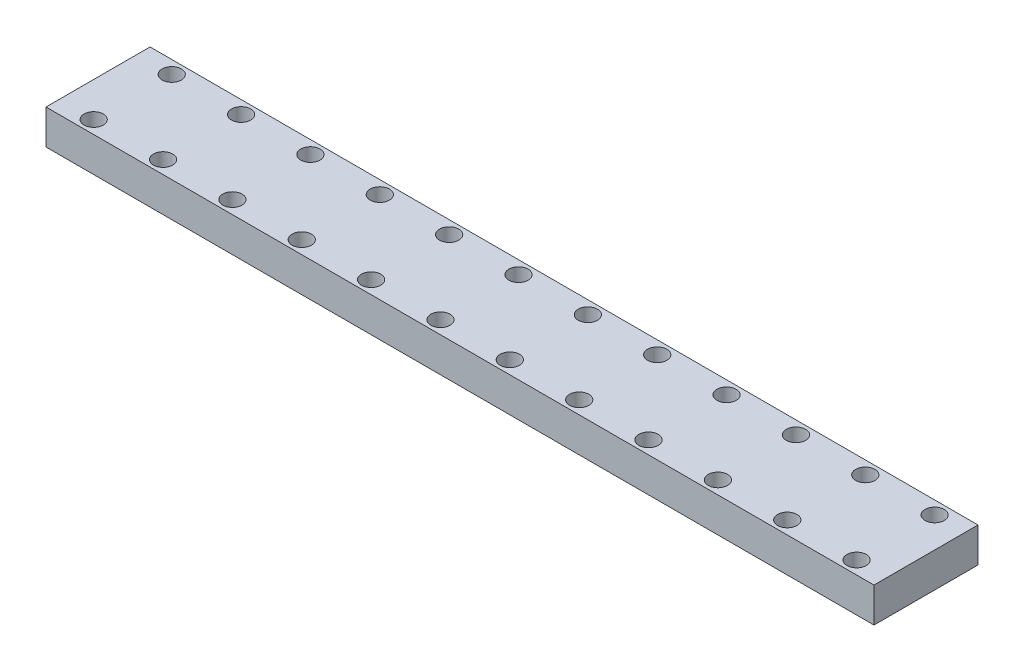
ISO-10303-21;
HEADER;
FILE_DESCRIPTION(('STEP AP214'),'2;1');
FILE_NAME('part.step','',(''),(''),'','','');
FILE_SCHEMA(('AUTOMOTIVE_DESIGN { 1 0 10303 214 1 1 1 1 }'));
ENDSEC;
DATA;
#1=APPLICATION_CONTEXT('core data for automotive mechanical design processes');
#2=APPLICATION_PROTOCOL_DEFINITION('international standard','automotive_design',2000,#1);
#3=PRODUCT_CONTEXT('',#1,'mechanical');
#4=PRODUCT('Part','Part','',(#3));
#5=PRODUCT_RELATED_PRODUCT_CATEGORY('part','',(#4));
#6=PRODUCT_DEFINITION_FORMATION('','',#4);
#7=PRODUCT_DEFINITION_CONTEXT('part definition',#1,'design');
#8=PRODUCT_DEFINITION('design','',#6,#7);
#9=PRODUCT_DEFINITION_SHAPE('','',#8);
#10=(LENGTH_UNIT() NAMED_UNIT(*) SI_UNIT(.MILLI.,.METRE.));
#11=(NAMED_UNIT(*) PLANE_ANGLE_UNIT() SI_UNIT($,.RADIAN.));
#12=(NAMED_UNIT(*) SI_UNIT($,.STERADIAN.) SOLID_ANGLE_UNIT());
#13=UNCERTAINTY_MEASURE_WITH_UNIT(LENGTH_MEASURE(1.E-05),#10,'distance_accuracy_value','');
#14=(GEOMETRIC_REPRESENTATION_CONTEXT(3) GLOBAL_UNCERTAINTY_ASSIGNED_CONTEXT((#13)) GLOBAL_UNIT_ASSIGNED_CONTEXT((#10,
#11,#12)) REPRESENTATION_CONTEXT('',''));
#15=CARTESIAN_POINT('',(0.,0.,0.));
#16=DIRECTION('',(0.,0.,1.));
#17=DIRECTION('',(1.,0.,0.));
#18=AXIS2_PLACEMENT_3D('',#15,#16,#17);
#19=CARTESIAN_POINT('',(0.,8.,0.));
#20=DIRECTION('',(0.,1.,0.));
#21=DIRECTION('',(0.,0.,1.));
#22=AXIS2_PLACEMENT_3D('',#19,#20,#21);
#23=PLANE('',#22);
#24=CARTESIAN_POINT('',(145.285714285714,8.,10.4285714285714));
#25=DIRECTION('',(0.,1.,0.));
#26=DIRECTION('',(0.,0.,1.));
#27=AXIS2_PLACEMENT_3D('',#24,#25,#26);
#28=CIRCLE('',#27,2.22212411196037);
#29=CARTESIAN_POINT('',(145.285714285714,8.,12.6506955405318));
#30=VERTEX_POINT('',#29);
#31=EDGE_CURVE('E243',#30,#30,#28,.T.);
#32=ORIENTED_EDGE('',*,*,#31,.F.);
#33=EDGE_LOOP('',(#32));
#34=FACE_BOUND('',#33,.T.);
#35=CARTESIAN_POINT('',(113.285714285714,8.,10.4285714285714));
#36=DIRECTION('',(0.,1.,0.));
#37=DIRECTION('',(0.,0.,1.));
#38=AXIS2_PLACEMENT_3D('',#35,#36,#37);
#39=CIRCLE('',#38,2.22212411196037);
#40=CARTESIAN_POINT('',(113.285714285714,8.,12.6506955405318));
#41=VERTEX_POINT('',#40);
#42=EDGE_CURVE('E231',#41,#41,#39,.T.);
#43=ORIENTED_EDGE('',*,*,#42,.F.);
#44=EDGE_LOOP('',(#43));
#45=FACE_BOUND('',#44,.T.);
#46=CARTESIAN_POINT('',(81.2857142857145,8.,10.4285714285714));
#47=DIRECTION('',(0.,1.,0.));
#48=DIRECTION('',(0.,0.,1.));
#49=AXIS2_PLACEMENT_3D('',#46,#47,#48);
#50=CIRCLE('',#49,2.22212411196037);
#51=CARTESIAN_POINT('',(81.2857142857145,8.,12.6506955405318));
#52=VERTEX_POINT('',#51);
#53=EDGE_CURVE('E219',#52,#52,#50,.T.);
#54=ORIENTED_EDGE('',*,*,#53,.F.);
#55=EDGE_LOOP('',(#54));
#56=FACE_BOUND('',#55,.T.);
#57=CARTESIAN_POINT('',(49.2857142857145,8.,10.4285714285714));
#58=DIRECTION('',(0.,1.,0.));
#59=DIRECTION('',(0.,0.,1.));
#60=AXIS2_PLACEMENT_3D('',#57,#58,#59);
#61=CIRCLE('',#60,2.22212411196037);
#62=CARTESIAN_POINT('',(49.2857142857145,8.,12.6506955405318));
#63=VERTEX_POINT('',#62);
#64=EDGE_CURVE('E207',#63,#63,#61,.T.);
#65=ORIENTED_EDGE('',*,*,#64,.F.);
#66=EDGE_LOOP('',(#65));
#67=FACE_BOUND('',#66,.T.);
#68=CARTESIAN_POINT('',(17.2857142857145,8.,10.4285714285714));
#69=DIRECTION('',(0.,1.,0.));
#70=DIRECTION('',(0.,0.,1.));
#71=AXIS2_PLACEMENT_3D('',#68,#69,#70);
#72=CIRCLE('',#71,2.22212411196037);
#73=CARTESIAN_POINT('',(17.2857142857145,8.,12.6506955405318));
#74=VERTEX_POINT('',#73);
#75=EDGE_CURVE('E195',#74,#74,#72,.T.);
#76=ORIENTED_EDGE('',*,*,#75,.F.);
#77=EDGE_LOOP('',(#76));
#78=FACE_BOUND('',#77,.T.);
#79=CARTESIAN_POINT('',(-14.7142857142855,8.,10.4285714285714));
#80=DIRECTION('',(0.,1.,0.));
#81=DIRECTION('',(0.,0.,1.));
#82=AXIS2_PLACEMENT_3D('',#79,#80,#81);
#83=CIRCLE('',#82,2.22212411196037);
#84=CARTESIAN_POINT('',(-14.7142857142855,8.,12.6506955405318));
#85=VERTEX_POINT('',#84);
#86=EDGE_CURVE('E183',#85,#85,#83,.T.);
#87=ORIENTED_EDGE('',*,*,#86,.F.);
#88=EDGE_LOOP('',(#87));
#89=FACE_BOUND('',#88,.T.);
#90=CARTESIAN_POINT('',(145.285714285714,8.,-7.57142857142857));
#91=DIRECTION('',(0.,1.,0.));
#92=DIRECTION('',(0.,0.,1.));
#93=AXIS2_PLACEMENT_3D('',#90,#91,#92);
#94=CIRCLE('',#93,2.22212411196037);
#95=CARTESIAN_POINT('',(145.285714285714,8.,-5.3493044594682));
#96=VERTEX_POINT('',#95);
#97=EDGE_CURVE('E171',#96,#96,#94,.T.);
#98=ORIENTED_EDGE('',*,*,#97,.F.);
#99=EDGE_LOOP('',(#98));
#100=FACE_BOUND('',#99,.T.);
#101=CARTESIAN_POINT('',(113.285714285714,8.,-7.57142857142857));
#102=DIRECTION('',(0.,1.,0.));
#103=DIRECTION('',(0.,0.,1.));
#104=AXIS2_PLACEMENT_3D('',#101,#102,#103);
#105=CIRCLE('',#104,2.22212411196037);
#106=CARTESIAN_POINT('',(113.285714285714,8.,-5.3493044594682));
#107=VERTEX_POINT('',#106);
#108=EDGE_CURVE('E159',#107,#107,#105,.T.);
#109=ORIENTED_EDGE('',*,*,#108,.F.);
#110=EDGE_LOOP('',(#109));
#111=FACE_BOUND('',#110,.T.);
#112=CARTESIAN_POINT('',(81.2857142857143,8.,-7.57142857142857));
#113=DIRECTION('',(0.,1.,0.));
#114=DIRECTION('',(0.,0.,1.));
#115=AXIS2_PLACEMENT_3D('',#112,#113,#114);
#116=CIRCLE('',#115,2.22212411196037);
#117=CARTESIAN_POINT('',(81.2857142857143,8.,-5.3493044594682));
#118=VERTEX_POINT('',#117);
#119=EDGE_CURVE('E147',#118,#118,#116,.T.);
#120=ORIENTED_EDGE('',*,*,#119,.F.);
#121=EDGE_LOOP('',(#120));
#122=FACE_BOUND('',#121,.T.);
#123=CARTESIAN_POINT('',(49.2857142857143,8.,-7.57142857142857));
#124=DIRECTION('',(0.,1.,0.));
#125=DIRECTION('',(0.,0.,1.));
#126=AXIS2_PLACEMENT_3D('',#123,#124,#125);
#127=CIRCLE('',#126,2.22212411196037);
#128=CARTESIAN_POINT('',(49.2857142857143,8.,-5.3493044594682));
#129=VERTEX_POINT('',#128);
#130=EDGE_CURVE('E135',#129,#129,#127,.T.);
#131=ORIENTED_EDGE('',*,*,#130,.F.);
#132=EDGE_LOOP('',(#131));
#133=FACE_BOUND('',#132,.T.);
#134=CARTESIAN_POINT('',(17.2857142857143,8.,-7.57142857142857));
#135=DIRECTION('',(0.,1.,0.));
#136=DIRECTION('',(0.,0.,1.));
#137=AXIS2_PLACEMENT_3D('',#134,#135,#136);
#138=CIRCLE('',#137,2.22212411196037);
#139=CARTESIAN_POINT('',(17.2857142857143,8.,-5.3493044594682));
#140=VERTEX_POINT('',#139);
#141=EDGE_CURVE('E123',#140,#140,#138,.T.);
#142=ORIENTED_EDGE('',*,*,#141,.F.);
#143=EDGE_LOOP('',(#142));
#144=FACE_BOUND('',#143,.T.);
#145=CARTESIAN_POINT('',(-14.7142857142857,8.,-7.57142857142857));
#146=DIRECTION('',(0.,1.,0.));
#147=DIRECTION('',(0.,0.,1.));
#148=AXIS2_PLACEMENT_3D('',#145,#146,#147);
#149=CIRCLE('',#148,2.22212411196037);
#150=CARTESIAN_POINT('',(-14.7142857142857,8.,-5.3493044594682));
#151=VERTEX_POINT('',#150);
#152=EDGE_CURVE('E102',#151,#151,#149,.T.);
#153=ORIENTED_EDGE('',*,*,#152,.F.);
#154=EDGE_LOOP('',(#153));
#155=FACE_BOUND('',#154,.T.);
#156=DIRECTION('',(0.,0.,1.));
#157=VECTOR('',#156,1.);
#158=CARTESIAN_POINT('',(-22.7142857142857,8.,-10.5714285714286));
#159=LINE('',#158,#157);
#160=CARTESIAN_POINT('',(-22.7142857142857,8.,-10.5714285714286));
#161=VERTEX_POINT('',#160);
#162=CARTESIAN_POINT('',(-22.7142857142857,8.,13.4285714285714));
#163=VERTEX_POINT('',#162);
#164=EDGE_CURVE('E87',#161,#163,#159,.T.);
#165=ORIENTED_EDGE('',*,*,#164,.T.);
#166=DIRECTION('',(1.,0.,0.));
#167=VECTOR('',#166,1.);
#168=CARTESIAN_POINT('',(-22.7142857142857,8.,13.4285714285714));
#169=LINE('',#168,#167);
#170=CARTESIAN_POINT('',(168.285714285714,8.,13.4285714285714));
#171=VERTEX_POINT('',#170);
#172=EDGE_CURVE('E82',#163,#171,#169,.T.);
#173=ORIENTED_EDGE('',*,*,#172,.T.);
#174=DIRECTION('',(0.,0.,-1.));
#175=VECTOR('',#174,1.);
#176=CARTESIAN_POINT('',(168.285714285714,8.,-10.5714285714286));
#177=LINE('',#176,#175);
#178=CARTESIAN_POINT('',(168.285714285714,8.,-10.5714285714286));
#179=VERTEX_POINT('',#178);
#180=EDGE_CURVE('E85',#171,#179,#177,.T.);
#181=ORIENTED_EDGE('',*,*,#180,.T.);
#182=DIRECTION('',(-1.,0.,0.));
#183=VECTOR('',#182,1.);
#184=CARTESIAN_POINT('',(-22.7142857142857,8.,-10.5714285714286));
#185=LINE('',#184,#183);
#186=EDGE_CURVE('E52',#179,#161,#185,.T.);
#187=ORIENTED_EDGE('',*,*,#186,.T.);
#188=EDGE_LOOP('',(#165,#173,#181,#187));
#189=FACE_BOUND('',#188,.T.);
#190=CARTESIAN_POINT('',(1.28571428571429,8.,-7.57142857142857));
#191=DIRECTION('',(0.,1.,0.));
#192=DIRECTION('',(0.,0.,1.));
#193=AXIS2_PLACEMENT_3D('',#190,#191,#192);
#194=CIRCLE('',#193,2.22212411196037);
#195=CARTESIAN_POINT('',(1.28571428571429,8.,-5.3493044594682));
#196=VERTEX_POINT('',#195);
#197=EDGE_CURVE('E117',#196,#196,#194,.T.);
#198=ORIENTED_EDGE('',*,*,#197,.F.);
#199=EDGE_LOOP('',(#198));
#200=FACE_BOUND('',#199,.T.);
#201=CARTESIAN_POINT('',(33.2857142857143,8.,-7.57142857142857));
#202=DIRECTION('',(0.,1.,0.));
#203=DIRECTION('',(0.,0.,1.));
#204=AXIS2_PLACEMENT_3D('',#201,#202,#203);
#205=CIRCLE('',#204,2.22212411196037);
#206=CARTESIAN_POINT('',(33.2857142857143,8.,-5.3493044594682));
#207=VERTEX_POINT('',#206);
#208=EDGE_CURVE('E129',#207,#207,#205,.T.);
#209=ORIENTED_EDGE('',*,*,#208,.F.);
#210=EDGE_LOOP('',(#209));
#211=FACE_BOUND('',#210,.T.);
#212=CARTESIAN_POINT('',(65.2857142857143,8.,-7.57142857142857));
#213=DIRECTION('',(0.,1.,0.));
#214=DIRECTION('',(0.,0.,1.));
#215=AXIS2_PLACEMENT_3D('',#212,#213,#214);
#216=CIRCLE('',#215,2.22212411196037);
#217=CARTESIAN_POINT('',(65.2857142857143,8.,-5.3493044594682));
#218=VERTEX_POINT('',#217);
#219=EDGE_CURVE('E141',#218,#218,#216,.T.);
#220=ORIENTED_EDGE('',*,*,#219,.F.);
#221=EDGE_LOOP('',(#220));
#222=FACE_BOUND('',#221,.T.);
#223=CARTESIAN_POINT('',(97.2857142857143,8.,-7.57142857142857));
#224=DIRECTION('',(0.,1.,0.));
#225=DIRECTION('',(0.,0.,1.));
#226=AXIS2_PLACEMENT_3D('',#223,#224,#225);
#227=CIRCLE('',#226,2.22212411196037);
#228=CARTESIAN_POINT('',(97.2857142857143,8.,-5.3493044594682));
#229=VERTEX_POINT('',#228);
#230=EDGE_CURVE('E153',#229,#229,#227,.T.);
#231=ORIENTED_EDGE('',*,*,#230,.F.);
#232=EDGE_LOOP('',(#231));
#233=FACE_BOUND('',#232,.T.);
#234=CARTESIAN_POINT('',(129.285714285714,8.,-7.57142857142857));
#235=DIRECTION('',(0.,1.,0.));
#236=DIRECTION('',(0.,0.,1.));
#237=AXIS2_PLACEMENT_3D('',#234,#235,#236);
#238=CIRCLE('',#237,2.22212411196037);
#239=CARTESIAN_POINT('',(129.285714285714,8.,-5.3493044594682));
#240=VERTEX_POINT('',#239);
#241=EDGE_CURVE('E165',#240,#240,#238,.T.);
#242=ORIENTED_EDGE('',*,*,#241,.F.);
#243=EDGE_LOOP('',(#242));
#244=FACE_BOUND('',#243,.T.);
#245=CARTESIAN_POINT('',(161.285714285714,8.,-7.57142857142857));
#246=DIRECTION('',(0.,1.,0.));
#247=DIRECTION('',(0.,0.,1.));
#248=AXIS2_PLACEMENT_3D('',#245,#246,#247);
#249=CIRCLE('',#248,2.22212411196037);
#250=CARTESIAN_POINT('',(161.285714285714,8.,-5.3493044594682));
#251=VERTEX_POINT('',#250);
#252=EDGE_CURVE('E177',#251,#251,#249,.T.);
#253=ORIENTED_EDGE('',*,*,#252,.F.);
#254=EDGE_LOOP('',(#253));
#255=FACE_BOUND('',#254,.T.);
#256=CARTESIAN_POINT('',(1.28571428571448,8.,10.4285714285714));
#257=DIRECTION('',(0.,1.,0.));
#258=DIRECTION('',(0.,0.,1.));
#259=AXIS2_PLACEMENT_3D('',#256,#257,#258);
#260=CIRCLE('',#259,2.22212411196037);
#261=CARTESIAN_POINT('',(1.28571428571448,8.,12.6506955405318));
#262=VERTEX_POINT('',#261);
#263=EDGE_CURVE('E189',#262,#262,#260,.T.);
#264=ORIENTED_EDGE('',*,*,#263,.F.);
#265=EDGE_LOOP('',(#264));
#266=FACE_BOUND('',#265,.T.);
#267=CARTESIAN_POINT('',(33.2857142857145,8.,10.4285714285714));
#268=DIRECTION('',(0.,1.,0.));
#269=DIRECTION('',(0.,0.,1.));
#270=AXIS2_PLACEMENT_3D('',#267,#268,#269);
#271=CIRCLE('',#270,2.22212411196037);
#272=CARTESIAN_POINT('',(33.2857142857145,8.,12.6506955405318));
#273=VERTEX_POINT('',#272);
#274=EDGE_CURVE('E201',#273,#273,#271,.T.);
#275=ORIENTED_EDGE('',*,*,#274,.F.);
#276=EDGE_LOOP('',(#275));
#277=FACE_BOUND('',#276,.T.);
#278=CARTESIAN_POINT('',(65.2857142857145,8.,10.4285714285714));
#279=DIRECTION('',(0.,1.,0.));
#280=DIRECTION('',(0.,0.,1.));
#281=AXIS2_PLACEMENT_3D('',#278,#279,#280);
#282=CIRCLE('',#281,2.22212411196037);
#283=CARTESIAN_POINT('',(65.2857142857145,8.,12.6506955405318));
#284=VERTEX_POINT('',#283);
#285=EDGE_CURVE('E213',#284,#284,#282,.T.);
#286=ORIENTED_EDGE('',*,*,#285,.F.);
#287=EDGE_LOOP('',(#286));
#288=FACE_BOUND('',#287,.T.);
#289=CARTESIAN_POINT('',(97.2857142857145,8.,10.4285714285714));
#290=DIRECTION('',(0.,1.,0.));
#291=DIRECTION('',(0.,0.,1.));
#292=AXIS2_PLACEMENT_3D('',#289,#290,#291);
#293=CIRCLE('',#292,2.22212411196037);
#294=CARTESIAN_POINT('',(97.2857142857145,8.,12.6506955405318));
#295=VERTEX_POINT('',#294);
#296=EDGE_CURVE('E225',#295,#295,#293,.T.);
#297=ORIENTED_EDGE('',*,*,#296,.F.);
#298=EDGE_LOOP('',(#297));
#299=FACE_BOUND('',#298,.T.);
#300=CARTESIAN_POINT('',(129.285714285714,8.,10.4285714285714));
#301=DIRECTION('',(0.,1.,0.));
#302=DIRECTION('',(0.,0.,1.));
#303=AXIS2_PLACEMENT_3D('',#300,#301,#302);
#304=CIRCLE('',#303,2.22212411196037);
#305=CARTESIAN_POINT('',(129.285714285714,8.,12.6506955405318));
#306=VERTEX_POINT('',#305);
#307=EDGE_CURVE('E237',#306,#306,#304,.T.);
#308=ORIENTED_EDGE('',*,*,#307,.F.);
#309=EDGE_LOOP('',(#308));
#310=FACE_BOUND('',#309,.T.);
#311=CARTESIAN_POINT('',(161.285714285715,8.,10.4285714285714));
#312=DIRECTION('',(0.,1.,0.));
#313=DIRECTION('',(0.,0.,1.));
#314=AXIS2_PLACEMENT_3D('',#311,#312,#313);
#315=CIRCLE('',#314,2.22212411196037);
#316=CARTESIAN_POINT('',(161.285714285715,8.,12.6506955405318));
#317=VERTEX_POINT('',#316);
#318=EDGE_CURVE('E249',#317,#317,#315,.T.);
#319=ORIENTED_EDGE('',*,*,#318,.F.);
#320=EDGE_LOOP('',(#319));
#321=FACE_BOUND('',#320,.T.);
#322=ADVANCED_FACE('F35',(#34,#45,#56,#67,#78,#89,#100,#111,#122,#133,#144,#155,#189,#200,#211,
#222,#233,#244,#255,#266,#277,#288,#299,#310,#321),#23,.T.);
#323=CARTESIAN_POINT('',(0.,0.,0.));
#324=DIRECTION('',(0.,1.,0.));
#325=DIRECTION('',(0.,0.,1.));
#326=AXIS2_PLACEMENT_3D('',#323,#324,#325);
#327=PLANE('',#326);
#328=DIRECTION('',(0.,0.,1.));
#329=VECTOR('',#328,1.);
#330=CARTESIAN_POINT('',(-22.7142857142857,0.,-10.5714285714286));
#331=LINE('',#330,#329);
#332=CARTESIAN_POINT('',(-22.7142857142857,0.,-10.5714285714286));
#333=VERTEX_POINT('',#332);
#334=CARTESIAN_POINT('',(-22.7142857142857,0.,13.4285714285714));
#335=VERTEX_POINT('',#334);
#336=EDGE_CURVE('E99',#333,#335,#331,.T.);
#337=ORIENTED_EDGE('',*,*,#336,.F.);
#338=DIRECTION('',(-1.,0.,0.));
#339=VECTOR('',#338,1.);
#340=CARTESIAN_POINT('',(-22.7142857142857,0.,-10.5714285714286));
#341=LINE('',#340,#339);
#342=CARTESIAN_POINT('',(168.285714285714,0.,-10.5714285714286));
#343=VERTEX_POINT('',#342);
#344=EDGE_CURVE('E75',#343,#333,#341,.T.);
#345=ORIENTED_EDGE('',*,*,#344,.F.);
#346=DIRECTION('',(0.,0.,-1.));
#347=VECTOR('',#346,1.);
#348=CARTESIAN_POINT('',(168.285714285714,0.,-10.5714285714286));
#349=LINE('',#348,#347);
#350=CARTESIAN_POINT('',(168.285714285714,0.,13.4285714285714));
#351=VERTEX_POINT('',#350);
#352=EDGE_CURVE('E69',#351,#343,#349,.T.);
#353=ORIENTED_EDGE('',*,*,#352,.F.);
#354=DIRECTION('',(1.,0.,0.));
#355=VECTOR('',#354,1.);
#356=CARTESIAN_POINT('',(-22.7142857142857,0.,13.4285714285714));
#357=LINE('',#356,#355);
#358=EDGE_CURVE('E91',#335,#351,#357,.T.);
#359=ORIENTED_EDGE('',*,*,#358,.F.);
#360=EDGE_LOOP('',(#337,#345,#353,#359));
#361=FACE_BOUND('',#360,.T.);
#362=CARTESIAN_POINT('',(-14.7142857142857,0.,-7.57142857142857));
#363=DIRECTION('',(0.,1.,0.));
#364=DIRECTION('',(0.,0.,1.));
#365=AXIS2_PLACEMENT_3D('',#362,#363,#364);
#366=CIRCLE('',#365,2.22212411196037);
#367=CARTESIAN_POINT('',(-14.7142857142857,0.,-5.3493044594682));
#368=VERTEX_POINT('',#367);
#369=EDGE_CURVE('E114',#368,#368,#366,.T.);
#370=ORIENTED_EDGE('',*,*,#369,.T.);
#371=EDGE_LOOP('',(#370));
#372=FACE_BOUND('',#371,.T.);
#373=CARTESIAN_POINT('',(1.28571428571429,0.,-7.57142857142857));
#374=DIRECTION('',(0.,1.,0.));
#375=DIRECTION('',(0.,0.,1.));
#376=AXIS2_PLACEMENT_3D('',#373,#374,#375);
#377=CIRCLE('',#376,2.22212411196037);
#378=CARTESIAN_POINT('',(1.28571428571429,0.,-5.3493044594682));
#379=VERTEX_POINT('',#378);
#380=EDGE_CURVE('E120',#379,#379,#377,.T.);
#381=ORIENTED_EDGE('',*,*,#380,.T.);
#382=EDGE_LOOP('',(#381));
#383=FACE_BOUND('',#382,.T.);
#384=CARTESIAN_POINT('',(17.2857142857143,0.,-7.57142857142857));
#385=DIRECTION('',(0.,1.,0.));
#386=DIRECTION('',(0.,0.,1.));
#387=AXIS2_PLACEMENT_3D('',#384,#385,#386);
#388=CIRCLE('',#387,2.22212411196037);
#389=CARTESIAN_POINT('',(17.2857142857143,0.,-5.3493044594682));
#390=VERTEX_POINT('',#389);
#391=EDGE_CURVE('E126',#390,#390,#388,.T.);
#392=ORIENTED_EDGE('',*,*,#391,.T.);
#393=EDGE_LOOP('',(#392));
#394=FACE_BOUND('',#393,.T.);
#395=CARTESIAN_POINT('',(33.2857142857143,0.,-7.57142857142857));
#396=DIRECTION('',(0.,1.,0.));
#397=DIRECTION('',(0.,0.,1.));
#398=AXIS2_PLACEMENT_3D('',#395,#396,#397);
#399=CIRCLE('',#398,2.22212411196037);
#400=CARTESIAN_POINT('',(33.2857142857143,0.,-5.3493044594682));
#401=VERTEX_POINT('',#400);
#402=EDGE_CURVE('E132',#401,#401,#399,.T.);
#403=ORIENTED_EDGE('',*,*,#402,.T.);
#404=EDGE_LOOP('',(#403));
#405=FACE_BOUND('',#404,.T.);
#406=CARTESIAN_POINT('',(49.2857142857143,0.,-7.57142857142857));
#407=DIRECTION('',(0.,1.,0.));
#408=DIRECTION('',(0.,0.,1.));
#409=AXIS2_PLACEMENT_3D('',#406,#407,#408);
#410=CIRCLE('',#409,2.22212411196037);
#411=CARTESIAN_POINT('',(49.2857142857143,0.,-5.3493044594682));
#412=VERTEX_POINT('',#411);
#413=EDGE_CURVE('E138',#412,#412,#410,.T.);
#414=ORIENTED_EDGE('',*,*,#413,.T.);
#415=EDGE_LOOP('',(#414));
#416=FACE_BOUND('',#415,.T.);
#417=CARTESIAN_POINT('',(65.2857142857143,0.,-7.57142857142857));
#418=DIRECTION('',(0.,1.,0.));
#419=DIRECTION('',(0.,0.,1.));
#420=AXIS2_PLACEMENT_3D('',#417,#418,#419);
#421=CIRCLE('',#420,2.22212411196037);
#422=CARTESIAN_POINT('',(65.2857142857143,0.,-5.3493044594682));
#423=VERTEX_POINT('',#422);
#424=EDGE_CURVE('E144',#423,#423,#421,.T.);
#425=ORIENTED_EDGE('',*,*,#424,.T.);
#426=EDGE_LOOP('',(#425));
#427=FACE_BOUND('',#426,.T.);
#428=CARTESIAN_POINT('',(81.2857142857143,0.,-7.57142857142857));
#429=DIRECTION('',(0.,1.,0.));
#430=DIRECTION('',(0.,0.,1.));
#431=AXIS2_PLACEMENT_3D('',#428,#429,#430);
#432=CIRCLE('',#431,2.22212411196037);
#433=CARTESIAN_POINT('',(81.2857142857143,0.,-5.3493044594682));
#434=VERTEX_POINT('',#433);
#435=EDGE_CURVE('E150',#434,#434,#432,.T.);
#436=ORIENTED_EDGE('',*,*,#435,.T.);
#437=EDGE_LOOP('',(#436));
#438=FACE_BOUND('',#437,.T.);
#439=CARTESIAN_POINT('',(97.2857142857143,0.,-7.57142857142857));
#440=DIRECTION('',(0.,1.,0.));
#441=DIRECTION('',(0.,0.,1.));
#442=AXIS2_PLACEMENT_3D('',#439,#440,#441);
#443=CIRCLE('',#442,2.22212411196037);
#444=CARTESIAN_POINT('',(97.2857142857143,0.,-5.3493044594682));
#445=VERTEX_POINT('',#444);
#446=EDGE_CURVE('E156',#445,#445,#443,.T.);
#447=ORIENTED_EDGE('',*,*,#446,.T.);
#448=EDGE_LOOP('',(#447));
#449=FACE_BOUND('',#448,.T.);
#450=CARTESIAN_POINT('',(113.285714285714,0.,-7.57142857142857));
#451=DIRECTION('',(0.,1.,0.));
#452=DIRECTION('',(0.,0.,1.));
#453=AXIS2_PLACEMENT_3D('',#450,#451,#452);
#454=CIRCLE('',#453,2.22212411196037);
#455=CARTESIAN_POINT('',(113.285714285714,0.,-5.3493044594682));
#456=VERTEX_POINT('',#455);
#457=EDGE_CURVE('E162',#456,#456,#454,.T.);
#458=ORIENTED_EDGE('',*,*,#457,.T.);
#459=EDGE_LOOP('',(#458));
#460=FACE_BOUND('',#459,.T.);
#461=CARTESIAN_POINT('',(129.285714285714,0.,-7.57142857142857));
#462=DIRECTION('',(0.,1.,0.));
#463=DIRECTION('',(0.,0.,1.));
#464=AXIS2_PLACEMENT_3D('',#461,#462,#463);
#465=CIRCLE('',#464,2.22212411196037);
#466=CARTESIAN_POINT('',(129.285714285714,0.,-5.3493044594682));
#467=VERTEX_POINT('',#466);
#468=EDGE_CURVE('E168',#467,#467,#465,.T.);
#469=ORIENTED_EDGE('',*,*,#468,.T.);
#470=EDGE_LOOP('',(#469));
#471=FACE_BOUND('',#470,.T.);
#472=CARTESIAN_POINT('',(145.285714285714,0.,-7.57142857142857));
#473=DIRECTION('',(0.,1.,0.));
#474=DIRECTION('',(0.,0.,1.));
#475=AXIS2_PLACEMENT_3D('',#472,#473,#474);
#476=CIRCLE('',#475,2.22212411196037);
#477=CARTESIAN_POINT('',(145.285714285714,0.,-5.3493044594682));
#478=VERTEX_POINT('',#477);
#479=EDGE_CURVE('E174',#478,#478,#476,.T.);
#480=ORIENTED_EDGE('',*,*,#479,.T.);
#481=EDGE_LOOP('',(#480));
#482=FACE_BOUND('',#481,.T.);
#483=CARTESIAN_POINT('',(161.285714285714,0.,-7.57142857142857));
#484=DIRECTION('',(0.,1.,0.));
#485=DIRECTION('',(0.,0.,1.));
#486=AXIS2_PLACEMENT_3D('',#483,#484,#485);
#487=CIRCLE('',#486,2.22212411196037);
#488=CARTESIAN_POINT('',(161.285714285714,0.,-5.3493044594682));
#489=VERTEX_POINT('',#488);
#490=EDGE_CURVE('E180',#489,#489,#487,.T.);
#491=ORIENTED_EDGE('',*,*,#490,.T.);
#492=EDGE_LOOP('',(#491));
#493=FACE_BOUND('',#492,.T.);
#494=CARTESIAN_POINT('',(-14.7142857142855,0.,10.4285714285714));
#495=DIRECTION('',(0.,1.,0.));
#496=DIRECTION('',(0.,0.,1.));
#497=AXIS2_PLACEMENT_3D('',#494,#495,#496);
#498=CIRCLE('',#497,2.22212411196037);
#499=CARTESIAN_POINT('',(-14.7142857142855,0.,12.6506955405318));
#500=VERTEX_POINT('',#499);
#501=EDGE_CURVE('E186',#500,#500,#498,.T.);
#502=ORIENTED_EDGE('',*,*,#501,.T.);
#503=EDGE_LOOP('',(#502));
#504=FACE_BOUND('',#503,.T.);
#505=CARTESIAN_POINT('',(1.28571428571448,0.,10.4285714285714));
#506=DIRECTION('',(0.,1.,0.));
#507=DIRECTION('',(0.,0.,1.));
#508=AXIS2_PLACEMENT_3D('',#505,#506,#507);
#509=CIRCLE('',#508,2.22212411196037);
#510=CARTESIAN_POINT('',(1.28571428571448,0.,12.6506955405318));
#511=VERTEX_POINT('',#510);
#512=EDGE_CURVE('E192',#511,#511,#509,.T.);
#513=ORIENTED_EDGE('',*,*,#512,.T.);
#514=EDGE_LOOP('',(#513));
#515=FACE_BOUND('',#514,.T.);
#516=CARTESIAN_POINT('',(17.2857142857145,0.,10.4285714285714));
#517=DIRECTION('',(0.,1.,0.));
#518=DIRECTION('',(0.,0.,1.));
#519=AXIS2_PLACEMENT_3D('',#516,#517,#518);
#520=CIRCLE('',#519,2.22212411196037);
#521=CARTESIAN_POINT('',(17.2857142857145,0.,12.6506955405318));
#522=VERTEX_POINT('',#521);
#523=EDGE_CURVE('E198',#522,#522,#520,.T.);
#524=ORIENTED_EDGE('',*,*,#523,.T.);
#525=EDGE_LOOP('',(#524));
#526=FACE_BOUND('',#525,.T.);
#527=CARTESIAN_POINT('',(33.2857142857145,0.,10.4285714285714));
#528=DIRECTION('',(0.,1.,0.));
#529=DIRECTION('',(0.,0.,1.));
#530=AXIS2_PLACEMENT_3D('',#527,#528,#529);
#531=CIRCLE('',#530,2.22212411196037);
#532=CARTESIAN_POINT('',(33.2857142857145,0.,12.6506955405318));
#533=VERTEX_POINT('',#532);
#534=EDGE_CURVE('E204',#533,#533,#531,.T.);
#535=ORIENTED_EDGE('',*,*,#534,.T.);
#536=EDGE_LOOP('',(#535));
#537=FACE_BOUND('',#536,.T.);
#538=CARTESIAN_POINT('',(49.2857142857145,0.,10.4285714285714));
#539=DIRECTION('',(0.,1.,0.));
#540=DIRECTION('',(0.,0.,1.));
#541=AXIS2_PLACEMENT_3D('',#538,#539,#540);
#542=CIRCLE('',#541,2.22212411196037);
#543=CARTESIAN_POINT('',(49.2857142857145,0.,12.6506955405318));
#544=VERTEX_POINT('',#543);
#545=EDGE_CURVE('E210',#544,#544,#542,.T.);
#546=ORIENTED_EDGE('',*,*,#545,.T.);
#547=EDGE_LOOP('',(#546));
#548=FACE_BOUND('',#547,.T.);
#549=CARTESIAN_POINT('',(65.2857142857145,0.,10.4285714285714));
#550=DIRECTION('',(0.,1.,0.));
#551=DIRECTION('',(0.,0.,1.));
#552=AXIS2_PLACEMENT_3D('',#549,#550,#551);
#553=CIRCLE('',#552,2.22212411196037);
#554=CARTESIAN_POINT('',(65.2857142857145,0.,12.6506955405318));
#555=VERTEX_POINT('',#554);
#556=EDGE_CURVE('E216',#555,#555,#553,.T.);
#557=ORIENTED_EDGE('',*,*,#556,.T.);
#558=EDGE_LOOP('',(#557));
#559=FACE_BOUND('',#558,.T.);
#560=CARTESIAN_POINT('',(81.2857142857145,0.,10.4285714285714));
#561=DIRECTION('',(0.,1.,0.));
#562=DIRECTION('',(0.,0.,1.));
#563=AXIS2_PLACEMENT_3D('',#560,#561,#562);
#564=CIRCLE('',#563,2.22212411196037);
#565=CARTESIAN_POINT('',(81.2857142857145,0.,12.6506955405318));
#566=VERTEX_POINT('',#565);
#567=EDGE_CURVE('E222',#566,#566,#564,.T.);
#568=ORIENTED_EDGE('',*,*,#567,.T.);
#569=EDGE_LOOP('',(#568));
#570=FACE_BOUND('',#569,.T.);
#571=CARTESIAN_POINT('',(97.2857142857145,0.,10.4285714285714));
#572=DIRECTION('',(0.,1.,0.));
#573=DIRECTION('',(0.,0.,1.));
#574=AXIS2_PLACEMENT_3D('',#571,#572,#573);
#575=CIRCLE('',#574,2.22212411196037);
#576=CARTESIAN_POINT('',(97.2857142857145,0.,12.6506955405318));
#577=VERTEX_POINT('',#576);
#578=EDGE_CURVE('E228',#577,#577,#575,.T.);
#579=ORIENTED_EDGE('',*,*,#578,.T.);
#580=EDGE_LOOP('',(#579));
#581=FACE_BOUND('',#580,.T.);
#582=CARTESIAN_POINT('',(113.285714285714,0.,10.4285714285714));
#583=DIRECTION('',(0.,1.,0.));
#584=DIRECTION('',(0.,0.,1.));
#585=AXIS2_PLACEMENT_3D('',#582,#583,#584);
#586=CIRCLE('',#585,2.22212411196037);
#587=CARTESIAN_POINT('',(113.285714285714,0.,12.6506955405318));
#588=VERTEX_POINT('',#587);
#589=EDGE_CURVE('E234',#588,#588,#586,.T.);
#590=ORIENTED_EDGE('',*,*,#589,.T.);
#591=EDGE_LOOP('',(#590));
#592=FACE_BOUND('',#591,.T.);
#593=CARTESIAN_POINT('',(129.285714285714,0.,10.4285714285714));
#594=DIRECTION('',(0.,1.,0.));
#595=DIRECTION('',(0.,0.,1.));
#596=AXIS2_PLACEMENT_3D('',#593,#594,#595);
#597=CIRCLE('',#596,2.22212411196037);
#598=CARTESIAN_POINT('',(129.285714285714,0.,12.6506955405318));
#599=VERTEX_POINT('',#598);
#600=EDGE_CURVE('E240',#599,#599,#597,.T.);
#601=ORIENTED_EDGE('',*,*,#600,.T.);
#602=EDGE_LOOP('',(#601));
#603=FACE_BOUND('',#602,.T.);
#604=CARTESIAN_POINT('',(145.285714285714,0.,10.4285714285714));
#605=DIRECTION('',(0.,1.,0.));
#606=DIRECTION('',(0.,0.,1.));
#607=AXIS2_PLACEMENT_3D('',#604,#605,#606);
#608=CIRCLE('',#607,2.22212411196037);
#609=CARTESIAN_POINT('',(145.285714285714,0.,12.6506955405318));
#610=VERTEX_POINT('',#609);
#611=EDGE_CURVE('E246',#610,#610,#608,.T.);
#612=ORIENTED_EDGE('',*,*,#611,.T.);
#613=EDGE_LOOP('',(#612));
#614=FACE_BOUND('',#613,.T.);
#615=CARTESIAN_POINT('',(161.285714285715,0.,10.4285714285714));
#616=DIRECTION('',(0.,1.,0.));
#617=DIRECTION('',(0.,0.,1.));
#618=AXIS2_PLACEMENT_3D('',#615,#616,#617);
#619=CIRCLE('',#618,2.22212411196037);
#620=CARTESIAN_POINT('',(161.285714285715,0.,12.6506955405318));
#621=VERTEX_POINT('',#620);
#622=EDGE_CURVE('E252',#621,#621,#619,.T.);
#623=ORIENTED_EDGE('',*,*,#622,.T.);
#624=EDGE_LOOP('',(#623));
#625=FACE_BOUND('',#624,.T.);
#626=ADVANCED_FACE('F110',(#361,#372,#383,#394,#405,#416,#427,#438,#449,#460,#471,#482,#493,
#504,#515,#526,#537,#548,#559,#570,#581,#592,#603,#614,#625),#327,.F.);
#627=CARTESIAN_POINT('',(-22.7142857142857,8.,-10.5714285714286));
#628=DIRECTION('',(1.,0.,0.));
#629=DIRECTION('',(0.,0.,-1.));
#630=AXIS2_PLACEMENT_3D('',#627,#628,#629);
#631=PLANE('',#630);
#632=ORIENTED_EDGE('',*,*,#336,.T.);
#633=DIRECTION('',(0.,-1.,0.));
#634=VECTOR('',#633,1.);
#635=CARTESIAN_POINT('',(-22.7142857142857,8.,13.4285714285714));
#636=LINE('',#635,#634);
#637=EDGE_CURVE('E11',#163,#335,#636,.T.);
#638=ORIENTED_EDGE('',*,*,#637,.F.);
#639=ORIENTED_EDGE('',*,*,#164,.F.);
#640=DIRECTION('',(0.,-1.,0.));
#641=VECTOR('',#640,1.);
#642=CARTESIAN_POINT('',(-22.7142857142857,8.,-10.5714285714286));
#643=LINE('',#642,#641);
#644=EDGE_CURVE('E95',#161,#333,#643,.T.);
#645=ORIENTED_EDGE('',*,*,#644,.T.);
#646=EDGE_LOOP('',(#632,#638,#639,#645));
#647=FACE_BOUND('',#646,.T.);
#648=ADVANCED_FACE('F37',(#647),#631,.F.);
#649=CARTESIAN_POINT('',(-22.7142857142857,8.,13.4285714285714));
#650=DIRECTION('',(0.,0.,-1.));
#651=DIRECTION('',(-1.,0.,0.));
#652=AXIS2_PLACEMENT_3D('',#649,#650,#651);
#653=PLANE('',#652);
#654=ORIENTED_EDGE('',*,*,#358,.T.);
#655=DIRECTION('',(0.,-1.,0.));
#656=VECTOR('',#655,1.);
#657=CARTESIAN_POINT('',(168.285714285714,8.,13.4285714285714));
#658=LINE('',#657,#656);
#659=EDGE_CURVE('E44',#171,#351,#658,.T.);
#660=ORIENTED_EDGE('',*,*,#659,.F.);
#661=ORIENTED_EDGE('',*,*,#172,.F.);
#662=ORIENTED_EDGE('',*,*,#637,.T.);
#663=EDGE_LOOP('',(#654,#660,#661,#662));
#664=FACE_BOUND('',#663,.T.);
#665=ADVANCED_FACE('F90',(#664),#653,.F.);
#666=CARTESIAN_POINT('',(168.285714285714,8.,-10.5714285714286));
#667=DIRECTION('',(-1.,0.,0.));
#668=DIRECTION('',(0.,0.,1.));
#669=AXIS2_PLACEMENT_3D('',#666,#667,#668);
#670=PLANE('',#669);
#671=ORIENTED_EDGE('',*,*,#352,.T.);
#672=DIRECTION('',(0.,-1.,0.));
#673=VECTOR('',#672,1.);
#674=CARTESIAN_POINT('',(168.285714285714,8.,-10.5714285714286));
#675=LINE('',#674,#673);
#676=EDGE_CURVE('E92',#179,#343,#675,.T.);
#677=ORIENTED_EDGE('',*,*,#676,.F.);
#678=ORIENTED_EDGE('',*,*,#180,.F.);
#679=ORIENTED_EDGE('',*,*,#659,.T.);
#680=EDGE_LOOP('',(#671,#677,#678,#679));
#681=FACE_BOUND('',#680,.T.);
#682=ADVANCED_FACE('F93',(#681),#670,.F.);
#683=CARTESIAN_POINT('',(-22.7142857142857,8.,-10.5714285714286));
#684=DIRECTION('',(0.,0.,1.));
#685=DIRECTION('',(1.,0.,0.));
#686=AXIS2_PLACEMENT_3D('',#683,#684,#685);
#687=PLANE('',#686);
#688=ORIENTED_EDGE('',*,*,#344,.T.);
#689=ORIENTED_EDGE('',*,*,#644,.F.);
#690=ORIENTED_EDGE('',*,*,#186,.F.);
#691=ORIENTED_EDGE('',*,*,#676,.T.);
#692=EDGE_LOOP('',(#688,#689,#690,#691));
#693=FACE_BOUND('',#692,.T.);
#694=ADVANCED_FACE('F107',(#693),#687,.F.);
#695=CARTESIAN_POINT('',(-14.7142857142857,8.,-7.57142857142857));
#696=DIRECTION('',(0.,-1.,0.));
#697=DIRECTION('',(0.,0.,-1.));
#698=AXIS2_PLACEMENT_3D('',#695,#696,#697);
#699=CYLINDRICAL_SURFACE('',#698,2.22212411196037);
#700=ORIENTED_EDGE('',*,*,#152,.T.);
#701=EDGE_LOOP('',(#700));
#702=FACE_BOUND('',#701,.T.);
#703=ORIENTED_EDGE('',*,*,#369,.F.);
#704=EDGE_LOOP('',(#703));
#705=FACE_BOUND('',#704,.T.);
#706=ADVANCED_FACE('F271',(#702,#705),#699,.F.);
#707=CARTESIAN_POINT('',(1.28571428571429,8.,-7.57142857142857));
#708=DIRECTION('',(0.,-1.,0.));
#709=DIRECTION('',(0.,0.,-1.));
#710=AXIS2_PLACEMENT_3D('',#707,#708,#709);
#711=CYLINDRICAL_SURFACE('',#710,2.22212411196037);
#712=ORIENTED_EDGE('',*,*,#197,.T.);
#713=EDGE_LOOP('',(#712));
#714=FACE_BOUND('',#713,.T.);
#715=ORIENTED_EDGE('',*,*,#380,.F.);
#716=EDGE_LOOP('',(#715));
#717=FACE_BOUND('',#716,.T.);
#718=ADVANCED_FACE('F317',(#714,#717),#711,.F.);
#719=CARTESIAN_POINT('',(17.2857142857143,8.,-7.57142857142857));
#720=DIRECTION('',(0.,-1.,0.));
#721=DIRECTION('',(0.,0.,-1.));
#722=AXIS2_PLACEMENT_3D('',#719,#720,#721);
#723=CYLINDRICAL_SURFACE('',#722,2.22212411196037);
#724=ORIENTED_EDGE('',*,*,#141,.T.);
#725=EDGE_LOOP('',(#724));
#726=FACE_BOUND('',#725,.T.);
#727=ORIENTED_EDGE('',*,*,#391,.F.);
#728=EDGE_LOOP('',(#727));
#729=FACE_BOUND('',#728,.T.);
#730=ADVANCED_FACE('F325',(#726,#729),#723,.F.);
#731=CARTESIAN_POINT('',(33.2857142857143,8.,-7.57142857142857));
#732=DIRECTION('',(0.,-1.,0.));
#733=DIRECTION('',(0.,0.,-1.));
#734=AXIS2_PLACEMENT_3D('',#731,#732,#733);
#735=CYLINDRICAL_SURFACE('',#734,2.22212411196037);
#736=ORIENTED_EDGE('',*,*,#208,.T.);
#737=EDGE_LOOP('',(#736));
#738=FACE_BOUND('',#737,.T.);
#739=ORIENTED_EDGE('',*,*,#402,.F.);
#740=EDGE_LOOP('',(#739));
#741=FACE_BOUND('',#740,.T.);
#742=ADVANCED_FACE('F333',(#738,#741),#735,.F.);
#743=CARTESIAN_POINT('',(49.2857142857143,8.,-7.57142857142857));
#744=DIRECTION('',(0.,-1.,0.));
#745=DIRECTION('',(0.,0.,-1.));
#746=AXIS2_PLACEMENT_3D('',#743,#744,#745);
#747=CYLINDRICAL_SURFACE('',#746,2.22212411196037);
#748=ORIENTED_EDGE('',*,*,#130,.T.);
#749=EDGE_LOOP('',(#748));
#750=FACE_BOUND('',#749,.T.);
#751=ORIENTED_EDGE('',*,*,#413,.F.);
#752=EDGE_LOOP('',(#751));
#753=FACE_BOUND('',#752,.T.);
#754=ADVANCED_FACE('F342',(#750,#753),#747,.F.);
#755=CARTESIAN_POINT('',(65.2857142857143,8.,-7.57142857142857));
#756=DIRECTION('',(0.,-1.,0.));
#757=DIRECTION('',(0.,0.,-1.));
#758=AXIS2_PLACEMENT_3D('',#755,#756,#757);
#759=CYLINDRICAL_SURFACE('',#758,2.22212411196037);
#760=ORIENTED_EDGE('',*,*,#219,.T.);
#761=EDGE_LOOP('',(#760));
#762=FACE_BOUND('',#761,.T.);
#763=ORIENTED_EDGE('',*,*,#424,.F.);
#764=EDGE_LOOP('',(#763));
#765=FACE_BOUND('',#764,.T.);
#766=ADVANCED_FACE('F351',(#762,#765),#759,.F.);
#767=CARTESIAN_POINT('',(81.2857142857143,8.,-7.57142857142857));
#768=DIRECTION('',(0.,-1.,0.));
#769=DIRECTION('',(0.,0.,-1.));
#770=AXIS2_PLACEMENT_3D('',#767,#768,#769);
#771=CYLINDRICAL_SURFACE('',#770,2.22212411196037);
#772=ORIENTED_EDGE('',*,*,#119,.T.);
#773=EDGE_LOOP('',(#772));
#774=FACE_BOUND('',#773,.T.);
#775=ORIENTED_EDGE('',*,*,#435,.F.);
#776=EDGE_LOOP('',(#775));
#777=FACE_BOUND('',#776,.T.);
#778=ADVANCED_FACE('F360',(#774,#777),#771,.F.);
#779=CARTESIAN_POINT('',(97.2857142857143,8.,-7.57142857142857));
#780=DIRECTION('',(0.,-1.,0.));
#781=DIRECTION('',(0.,0.,-1.));
#782=AXIS2_PLACEMENT_3D('',#779,#780,#781);
#783=CYLINDRICAL_SURFACE('',#782,2.22212411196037);
#784=ORIENTED_EDGE('',*,*,#230,.T.);
#785=EDGE_LOOP('',(#784));
#786=FACE_BOUND('',#785,.T.);
#787=ORIENTED_EDGE('',*,*,#446,.F.);
#788=EDGE_LOOP('',(#787));
#789=FACE_BOUND('',#788,.T.);
#790=ADVANCED_FACE('F369',(#786,#789),#783,.F.);
#791=CARTESIAN_POINT('',(113.285714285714,8.,-7.57142857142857));
#792=DIRECTION('',(0.,-1.,0.));
#793=DIRECTION('',(0.,0.,-1.));
#794=AXIS2_PLACEMENT_3D('',#791,#792,#793);
#795=CYLINDRICAL_SURFACE('',#794,2.22212411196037);
#796=ORIENTED_EDGE('',*,*,#108,.T.);
#797=EDGE_LOOP('',(#796));
#798=FACE_BOUND('',#797,.T.);
#799=ORIENTED_EDGE('',*,*,#457,.F.);
#800=EDGE_LOOP('',(#799));
#801=FACE_BOUND('',#800,.T.);
#802=ADVANCED_FACE('F378',(#798,#801),#795,.F.);
#803=CARTESIAN_POINT('',(129.285714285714,8.,-7.57142857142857));
#804=DIRECTION('',(0.,-1.,0.));
#805=DIRECTION('',(0.,0.,-1.));
#806=AXIS2_PLACEMENT_3D('',#803,#804,#805);
#807=CYLINDRICAL_SURFACE('',#806,2.22212411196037);
#808=ORIENTED_EDGE('',*,*,#241,.T.);
#809=EDGE_LOOP('',(#808));
#810=FACE_BOUND('',#809,.T.);
#811=ORIENTED_EDGE('',*,*,#468,.F.);
#812=EDGE_LOOP('',(#811));
#813=FACE_BOUND('',#812,.T.);
#814=ADVANCED_FACE('F387',(#810,#813),#807,.F.);
#815=CARTESIAN_POINT('',(145.285714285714,8.,-7.57142857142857));
#816=DIRECTION('',(0.,-1.,0.));
#817=DIRECTION('',(0.,0.,-1.));
#818=AXIS2_PLACEMENT_3D('',#815,#816,#817);
#819=CYLINDRICAL_SURFACE('',#818,2.22212411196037);
#820=ORIENTED_EDGE('',*,*,#97,.T.);
#821=EDGE_LOOP('',(#820));
#822=FACE_BOUND('',#821,.T.);
#823=ORIENTED_EDGE('',*,*,#479,.F.);
#824=EDGE_LOOP('',(#823));
#825=FACE_BOUND('',#824,.T.);
#826=ADVANCED_FACE('F396',(#822,#825),#819,.F.);
#827=CARTESIAN_POINT('',(161.285714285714,8.,-7.57142857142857));
#828=DIRECTION('',(0.,-1.,0.));
#829=DIRECTION('',(0.,0.,-1.));
#830=AXIS2_PLACEMENT_3D('',#827,#828,#829);
#831=CYLINDRICAL_SURFACE('',#830,2.22212411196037);
#832=ORIENTED_EDGE('',*,*,#252,.T.);
#833=EDGE_LOOP('',(#832));
#834=FACE_BOUND('',#833,.T.);
#835=ORIENTED_EDGE('',*,*,#490,.F.);
#836=EDGE_LOOP('',(#835));
#837=FACE_BOUND('',#836,.T.);
#838=ADVANCED_FACE('F405',(#834,#837),#831,.F.);
#839=CARTESIAN_POINT('',(-14.7142857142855,8.,10.4285714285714));
#840=DIRECTION('',(0.,-1.,0.));
#841=DIRECTION('',(0.,0.,-1.));
#842=AXIS2_PLACEMENT_3D('',#839,#840,#841);
#843=CYLINDRICAL_SURFACE('',#842,2.22212411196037);
#844=ORIENTED_EDGE('',*,*,#86,.T.);
#845=EDGE_LOOP('',(#844));
#846=FACE_BOUND('',#845,.T.);
#847=ORIENTED_EDGE('',*,*,#501,.F.);
#848=EDGE_LOOP('',(#847));
#849=FACE_BOUND('',#848,.T.);
#850=ADVANCED_FACE('F414',(#846,#849),#843,.F.);
#851=CARTESIAN_POINT('',(1.28571428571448,8.,10.4285714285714));
#852=DIRECTION('',(0.,-1.,0.));
#853=DIRECTION('',(0.,0.,-1.));
#854=AXIS2_PLACEMENT_3D('',#851,#852,#853);
#855=CYLINDRICAL_SURFACE('',#854,2.22212411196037);
#856=ORIENTED_EDGE('',*,*,#263,.T.);
#857=EDGE_LOOP('',(#856));
#858=FACE_BOUND('',#857,.T.);
#859=ORIENTED_EDGE('',*,*,#512,.F.);
#860=EDGE_LOOP('',(#859));
#861=FACE_BOUND('',#860,.T.);
#862=ADVANCED_FACE('F423',(#858,#861),#855,.F.);
#863=CARTESIAN_POINT('',(17.2857142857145,8.,10.4285714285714));
#864=DIRECTION('',(0.,-1.,0.));
#865=DIRECTION('',(0.,0.,-1.));
#866=AXIS2_PLACEMENT_3D('',#863,#864,#865);
#867=CYLINDRICAL_SURFACE('',#866,2.22212411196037);
#868=ORIENTED_EDGE('',*,*,#75,.T.);
#869=EDGE_LOOP('',(#868));
#870=FACE_BOUND('',#869,.T.);
#871=ORIENTED_EDGE('',*,*,#523,.F.);
#872=EDGE_LOOP('',(#871));
#873=FACE_BOUND('',#872,.T.);
#874=ADVANCED_FACE('F432',(#870,#873),#867,.F.);
#875=CARTESIAN_POINT('',(33.2857142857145,8.,10.4285714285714));
#876=DIRECTION('',(0.,-1.,0.));
#877=DIRECTION('',(0.,0.,-1.));
#878=AXIS2_PLACEMENT_3D('',#875,#876,#877);
#879=CYLINDRICAL_SURFACE('',#878,2.22212411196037);
#880=ORIENTED_EDGE('',*,*,#274,.T.);
#881=EDGE_LOOP('',(#880));
#882=FACE_BOUND('',#881,.T.);
#883=ORIENTED_EDGE('',*,*,#534,.F.);
#884=EDGE_LOOP('',(#883));
#885=FACE_BOUND('',#884,.T.);
#886=ADVANCED_FACE('F441',(#882,#885),#879,.F.);
#887=CARTESIAN_POINT('',(49.2857142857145,8.,10.4285714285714));
#888=DIRECTION('',(0.,-1.,0.));
#889=DIRECTION('',(0.,0.,-1.));
#890=AXIS2_PLACEMENT_3D('',#887,#888,#889);
#891=CYLINDRICAL_SURFACE('',#890,2.22212411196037);
#892=ORIENTED_EDGE('',*,*,#64,.T.);
#893=EDGE_LOOP('',(#892));
#894=FACE_BOUND('',#893,.T.);
#895=ORIENTED_EDGE('',*,*,#545,.F.);
#896=EDGE_LOOP('',(#895));
#897=FACE_BOUND('',#896,.T.);
#898=ADVANCED_FACE('F450',(#894,#897),#891,.F.);
#899=CARTESIAN_POINT('',(65.2857142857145,8.,10.4285714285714));
#900=DIRECTION('',(0.,-1.,0.));
#901=DIRECTION('',(0.,0.,-1.));
#902=AXIS2_PLACEMENT_3D('',#899,#900,#901);
#903=CYLINDRICAL_SURFACE('',#902,2.22212411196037);
#904=ORIENTED_EDGE('',*,*,#285,.T.);
#905=EDGE_LOOP('',(#904));
#906=FACE_BOUND('',#905,.T.);
#907=ORIENTED_EDGE('',*,*,#556,.F.);
#908=EDGE_LOOP('',(#907));
#909=FACE_BOUND('',#908,.T.);
#910=ADVANCED_FACE('F459',(#906,#909),#903,.F.);
#911=CARTESIAN_POINT('',(81.2857142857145,8.,10.4285714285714));
#912=DIRECTION('',(0.,-1.,0.));
#913=DIRECTION('',(0.,0.,-1.));
#914=AXIS2_PLACEMENT_3D('',#911,#912,#913);
#915=CYLINDRICAL_SURFACE('',#914,2.22212411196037);
#916=ORIENTED_EDGE('',*,*,#53,.T.);
#917=EDGE_LOOP('',(#916));
#918=FACE_BOUND('',#917,.T.);
#919=ORIENTED_EDGE('',*,*,#567,.F.);
#920=EDGE_LOOP('',(#919));
#921=FACE_BOUND('',#920,.T.);
#922=ADVANCED_FACE('F468',(#918,#921),#915,.F.);
#923=CARTESIAN_POINT('',(97.2857142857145,8.,10.4285714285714));
#924=DIRECTION('',(0.,-1.,0.));
#925=DIRECTION('',(0.,0.,-1.));
#926=AXIS2_PLACEMENT_3D('',#923,#924,#925);
#927=CYLINDRICAL_SURFACE('',#926,2.22212411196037);
#928=ORIENTED_EDGE('',*,*,#296,.T.);
#929=EDGE_LOOP('',(#928));
#930=FACE_BOUND('',#929,.T.);
#931=ORIENTED_EDGE('',*,*,#578,.F.);
#932=EDGE_LOOP('',(#931));
#933=FACE_BOUND('',#932,.T.);
#934=ADVANCED_FACE('F477',(#930,#933),#927,.F.);
#935=CARTESIAN_POINT('',(113.285714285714,8.,10.4285714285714));
#936=DIRECTION('',(0.,-1.,0.));
#937=DIRECTION('',(0.,0.,-1.));
#938=AXIS2_PLACEMENT_3D('',#935,#936,#937);
#939=CYLINDRICAL_SURFACE('',#938,2.22212411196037);
#940=ORIENTED_EDGE('',*,*,#42,.T.);
#941=EDGE_LOOP('',(#940));
#942=FACE_BOUND('',#941,.T.);
#943=ORIENTED_EDGE('',*,*,#589,.F.);
#944=EDGE_LOOP('',(#943));
#945=FACE_BOUND('',#944,.T.);
#946=ADVANCED_FACE('F486',(#942,#945),#939,.F.);
#947=CARTESIAN_POINT('',(129.285714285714,8.,10.4285714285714));
#948=DIRECTION('',(0.,-1.,0.));
#949=DIRECTION('',(0.,0.,-1.));
#950=AXIS2_PLACEMENT_3D('',#947,#948,#949);
#951=CYLINDRICAL_SURFACE('',#950,2.22212411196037);
#952=ORIENTED_EDGE('',*,*,#307,.T.);
#953=EDGE_LOOP('',(#952));
#954=FACE_BOUND('',#953,.T.);
#955=ORIENTED_EDGE('',*,*,#600,.F.);
#956=EDGE_LOOP('',(#955));
#957=FACE_BOUND('',#956,.T.);
#958=ADVANCED_FACE('F495',(#954,#957),#951,.F.);
#959=CARTESIAN_POINT('',(145.285714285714,8.,10.4285714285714));
#960=DIRECTION('',(0.,-1.,0.));
#961=DIRECTION('',(0.,0.,-1.));
#962=AXIS2_PLACEMENT_3D('',#959,#960,#961);
#963=CYLINDRICAL_SURFACE('',#962,2.22212411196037);
#964=ORIENTED_EDGE('',*,*,#31,.T.);
#965=EDGE_LOOP('',(#964));
#966=FACE_BOUND('',#965,.T.);
#967=ORIENTED_EDGE('',*,*,#611,.F.);
#968=EDGE_LOOP('',(#967));
#969=FACE_BOUND('',#968,.T.);
#970=ADVANCED_FACE('F504',(#966,#969),#963,.F.);
#971=CARTESIAN_POINT('',(161.285714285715,8.,10.4285714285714));
#972=DIRECTION('',(0.,-1.,0.));
#973=DIRECTION('',(0.,0.,-1.));
#974=AXIS2_PLACEMENT_3D('',#971,#972,#973);
#975=CYLINDRICAL_SURFACE('',#974,2.22212411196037);
#976=ORIENTED_EDGE('',*,*,#318,.T.);
#977=EDGE_LOOP('',(#976));
#978=FACE_BOUND('',#977,.T.);
#979=ORIENTED_EDGE('',*,*,#622,.F.);
#980=EDGE_LOOP('',(#979));
#981=FACE_BOUND('',#980,.T.);
#982=ADVANCED_FACE('F258',(#978,#981),#975,.F.);
#983=CLOSED_SHELL('',(#322,#626,#648,#665,#682,#694,#706,#718,#730,#742,#754,#766,#778,#790,
#802,#814,#826,#838,#850,#862,#874,#886,#898,#910,#922,#934,#946,#958,#970,#982));
#984=MANIFOLD_SOLID_BREP('B2',#983);
#985=ADVANCED_BREP_SHAPE_REPRESENTATION('',(#18,#984),#14);
#986=SHAPE_DEFINITION_REPRESENTATION(#9,#985);
ENDSEC;
END-ISO-10303-21;
